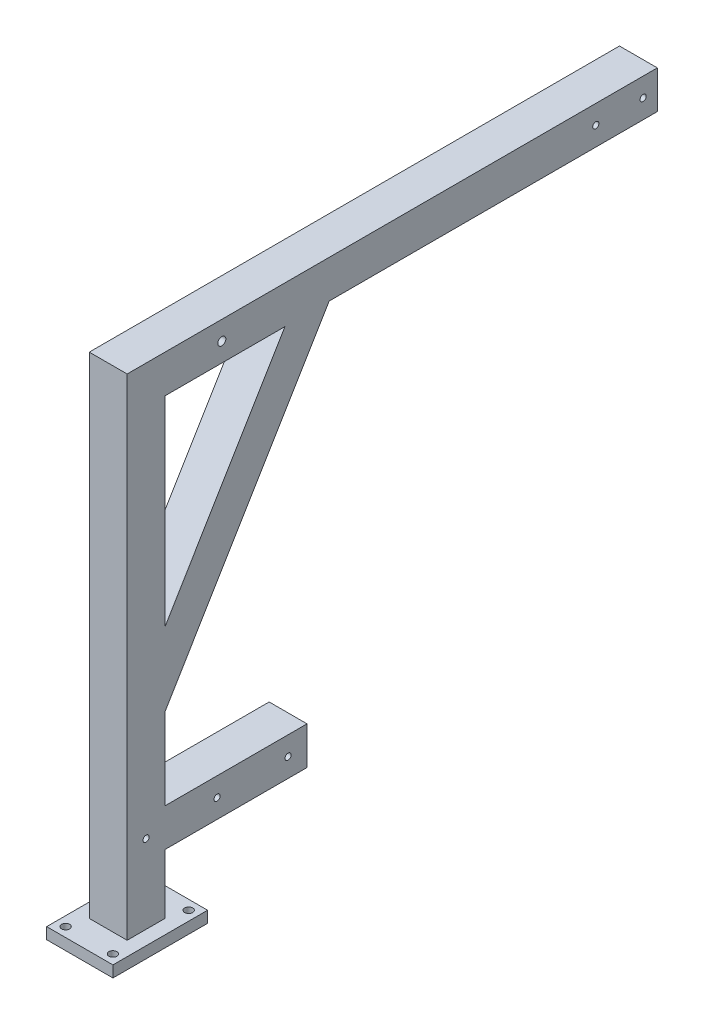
ISO-10303-21;
HEADER;
FILE_DESCRIPTION(('STEP AP214'),'2;1');
FILE_NAME('part.step','',(''),(''),'','','');
FILE_SCHEMA(('AUTOMOTIVE_DESIGN { 1 0 10303 214 1 1 1 1 }'));
ENDSEC;
DATA;
#1=APPLICATION_CONTEXT('core data for automotive mechanical design processes');
#2=APPLICATION_PROTOCOL_DEFINITION('international standard','automotive_design',2000,#1);
#3=PRODUCT_CONTEXT('',#1,'mechanical');
#4=PRODUCT('Part','Part','',(#3));
#5=PRODUCT_RELATED_PRODUCT_CATEGORY('part','',(#4));
#6=PRODUCT_DEFINITION_FORMATION('','',#4);
#7=PRODUCT_DEFINITION_CONTEXT('part definition',#1,'design');
#8=PRODUCT_DEFINITION('design','',#6,#7);
#9=PRODUCT_DEFINITION_SHAPE('','',#8);
#10=(LENGTH_UNIT() NAMED_UNIT(*) SI_UNIT(.MILLI.,.METRE.));
#11=(NAMED_UNIT(*) PLANE_ANGLE_UNIT() SI_UNIT($,.RADIAN.));
#12=(NAMED_UNIT(*) SI_UNIT($,.STERADIAN.) SOLID_ANGLE_UNIT());
#13=UNCERTAINTY_MEASURE_WITH_UNIT(LENGTH_MEASURE(1.E-05),#10,'distance_accuracy_value','');
#14=(GEOMETRIC_REPRESENTATION_CONTEXT(3) GLOBAL_UNCERTAINTY_ASSIGNED_CONTEXT((#13)) GLOBAL_UNIT_ASSIGNED_CONTEXT((#10,
#11,#12)) REPRESENTATION_CONTEXT('',''));
#15=CARTESIAN_POINT('',(0.,0.,0.));
#16=DIRECTION('',(0.,0.,1.));
#17=DIRECTION('',(1.,0.,0.));
#18=AXIS2_PLACEMENT_3D('',#15,#16,#17);
#19=CARTESIAN_POINT('',(70.,0.,590.));
#20=DIRECTION('',(0.,1.,0.));
#21=DIRECTION('',(0.,0.,1.));
#22=AXIS2_PLACEMENT_3D('',#19,#20,#21);
#23=PLANE('',#22);
#24=CARTESIAN_POINT('',(10.,0.,580.));
#25=DIRECTION('',(0.,1.,0.));
#26=DIRECTION('',(0.,0.,1.));
#27=AXIS2_PLACEMENT_3D('',#24,#25,#26);
#28=CIRCLE('',#27,4.25);
#29=CARTESIAN_POINT('',(10.,0.,584.25));
#30=VERTEX_POINT('',#29);
#31=EDGE_CURVE('E318',#30,#30,#28,.T.);
#32=ORIENTED_EDGE('',*,*,#31,.T.);
#33=EDGE_LOOP('',(#32));
#34=FACE_BOUND('',#33,.T.);
#35=CARTESIAN_POINT('',(60.,0.,580.));
#36=DIRECTION('',(0.,1.,0.));
#37=DIRECTION('',(0.,0.,1.));
#38=AXIS2_PLACEMENT_3D('',#35,#36,#37);
#39=CIRCLE('',#38,4.25);
#40=CARTESIAN_POINT('',(60.,0.,584.25));
#41=VERTEX_POINT('',#40);
#42=EDGE_CURVE('E312',#41,#41,#39,.T.);
#43=ORIENTED_EDGE('',*,*,#42,.T.);
#44=EDGE_LOOP('',(#43));
#45=FACE_BOUND('',#44,.T.);
#46=CARTESIAN_POINT('',(60.,0.,500.));
#47=DIRECTION('',(0.,1.,0.));
#48=DIRECTION('',(0.,0.,1.));
#49=AXIS2_PLACEMENT_3D('',#46,#47,#48);
#50=CIRCLE('',#49,4.25);
#51=CARTESIAN_POINT('',(60.,0.,504.25));
#52=VERTEX_POINT('',#51);
#53=EDGE_CURVE('E306',#52,#52,#50,.T.);
#54=ORIENTED_EDGE('',*,*,#53,.T.);
#55=EDGE_LOOP('',(#54));
#56=FACE_BOUND('',#55,.T.);
#57=CARTESIAN_POINT('',(10.,0.,500.));
#58=DIRECTION('',(0.,1.,0.));
#59=DIRECTION('',(0.,0.,1.));
#60=AXIS2_PLACEMENT_3D('',#57,#58,#59);
#61=CIRCLE('',#60,4.25);
#62=CARTESIAN_POINT('',(10.,0.,504.25));
#63=VERTEX_POINT('',#62);
#64=EDGE_CURVE('E300',#63,#63,#61,.T.);
#65=ORIENTED_EDGE('',*,*,#64,.T.);
#66=EDGE_LOOP('',(#65));
#67=FACE_BOUND('',#66,.T.);
#68=DIRECTION('',(-1.,0.,0.));
#69=VECTOR('',#68,1.);
#70=CARTESIAN_POINT('',(15.,0.,490.));
#71=LINE('',#70,#69);
#72=CARTESIAN_POINT('',(70.,0.,490.));
#73=VERTEX_POINT('',#72);
#74=CARTESIAN_POINT('',(0.,0.,490.));
#75=VERTEX_POINT('',#74);
#76=EDGE_CURVE('E278',#73,#75,#71,.T.);
#77=ORIENTED_EDGE('',*,*,#76,.F.);
#78=DIRECTION('',(0.,0.,-1.));
#79=VECTOR('',#78,1.);
#80=CARTESIAN_POINT('',(70.,0.,590.));
#81=LINE('',#80,#79);
#82=CARTESIAN_POINT('',(70.,0.,590.));
#83=VERTEX_POINT('',#82);
#84=EDGE_CURVE('E270',#83,#73,#81,.T.);
#85=ORIENTED_EDGE('',*,*,#84,.F.);
#86=DIRECTION('',(1.,0.,0.));
#87=VECTOR('',#86,1.);
#88=CARTESIAN_POINT('',(70.,0.,590.));
#89=LINE('',#88,#87);
#90=CARTESIAN_POINT('',(0.,0.,590.));
#91=VERTEX_POINT('',#90);
#92=EDGE_CURVE('E280',#91,#83,#89,.T.);
#93=ORIENTED_EDGE('',*,*,#92,.F.);
#94=DIRECTION('',(0.,0.,-1.));
#95=VECTOR('',#94,1.);
#96=CARTESIAN_POINT('',(0.,0.,590.));
#97=LINE('',#96,#95);
#98=EDGE_CURVE('E189',#91,#75,#97,.T.);
#99=ORIENTED_EDGE('',*,*,#98,.T.);
#100=EDGE_LOOP('',(#77,#85,#93,#99));
#101=FACE_BOUND('',#100,.T.);
#102=ADVANCED_FACE('F34',(#34,#45,#56,#67,#101),#23,.F.);
#103=CARTESIAN_POINT('',(55.,12.,0.));
#104=DIRECTION('',(0.,0.,-1.));
#105=DIRECTION('',(-1.,0.,0.));
#106=AXIS2_PLACEMENT_3D('',#103,#104,#105);
#107=PLANE('',#106);
#108=DIRECTION('',(0.,1.,0.));
#109=VECTOR('',#108,1.);
#110=CARTESIAN_POINT('',(55.,489.999999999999,0.));
#111=LINE('',#110,#109);
#112=CARTESIAN_POINT('',(55.,490.,0.));
#113=VERTEX_POINT('',#112);
#114=CARTESIAN_POINT('',(55.,529.999999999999,0.));
#115=VERTEX_POINT('',#114);
#116=EDGE_CURVE('E256',#113,#115,#111,.T.);
#117=ORIENTED_EDGE('',*,*,#116,.F.);
#118=DIRECTION('',(1.,0.,0.));
#119=VECTOR('',#118,1.);
#120=CARTESIAN_POINT('',(-520.,490.,0.));
#121=LINE('',#120,#119);
#122=CARTESIAN_POINT('',(15.,490.,0.));
#123=VERTEX_POINT('',#122);
#124=EDGE_CURVE('E243',#123,#113,#121,.T.);
#125=ORIENTED_EDGE('',*,*,#124,.F.);
#126=DIRECTION('',(0.,-1.,0.));
#127=VECTOR('',#126,1.);
#128=CARTESIAN_POINT('',(15.,12.,0.));
#129=LINE('',#128,#127);
#130=CARTESIAN_POINT('',(15.,529.999999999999,0.));
#131=VERTEX_POINT('',#130);
#132=EDGE_CURVE('E254',#131,#123,#129,.T.);
#133=ORIENTED_EDGE('',*,*,#132,.F.);
#134=DIRECTION('',(-1.,0.,0.));
#135=VECTOR('',#134,1.);
#136=CARTESIAN_POINT('',(55.,529.999999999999,0.));
#137=LINE('',#136,#135);
#138=EDGE_CURVE('E261',#115,#131,#137,.T.);
#139=ORIENTED_EDGE('',*,*,#138,.F.);
#140=EDGE_LOOP('',(#117,#125,#133,#139));
#141=FACE_BOUND('',#140,.T.);
#142=ADVANCED_FACE('F252',(#141),#107,.T.);
#143=CARTESIAN_POINT('',(55.,489.999999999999,590.));
#144=DIRECTION('',(-1.,0.,0.));
#145=DIRECTION('',(0.,0.,1.));
#146=AXIS2_PLACEMENT_3D('',#143,#144,#145);
#147=PLANE('',#146);
#148=CARTESIAN_POINT('',(55.,510.,65.));
#149=DIRECTION('',(-1.,0.,0.));
#150=DIRECTION('',(0.,0.,1.));
#151=AXIS2_PLACEMENT_3D('',#148,#149,#150);
#152=CIRCLE('',#151,3.25);
#153=CARTESIAN_POINT('',(55.,510.,68.25));
#154=VERTEX_POINT('',#153);
#155=EDGE_CURVE('E225',#154,#154,#152,.T.);
#156=ORIENTED_EDGE('',*,*,#155,.T.);
#157=EDGE_LOOP('',(#156));
#158=FACE_BOUND('',#157,.T.);
#159=CARTESIAN_POINT('',(55.,510.,15.));
#160=DIRECTION('',(-1.,0.,0.));
#161=DIRECTION('',(0.,0.,1.));
#162=AXIS2_PLACEMENT_3D('',#159,#160,#161);
#163=CIRCLE('',#162,3.25);
#164=CARTESIAN_POINT('',(55.,510.,18.25));
#165=VERTEX_POINT('',#164);
#166=EDGE_CURVE('E221',#165,#165,#163,.T.);
#167=ORIENTED_EDGE('',*,*,#166,.T.);
#168=EDGE_LOOP('',(#167));
#169=FACE_BOUND('',#168,.T.);
#170=CARTESIAN_POINT('',(55.,510.,460.));
#171=DIRECTION('',(-1.,0.,0.));
#172=DIRECTION('',(0.,0.,1.));
#173=AXIS2_PLACEMENT_3D('',#170,#171,#172);
#174=CIRCLE('',#173,4.24999999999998);
#175=CARTESIAN_POINT('',(55.,510.,464.25));
#176=VERTEX_POINT('',#175);
#177=EDGE_CURVE('E217',#176,#176,#174,.T.);
#178=ORIENTED_EDGE('',*,*,#177,.T.);
#179=EDGE_LOOP('',(#178));
#180=FACE_BOUND('',#179,.T.);
#181=CARTESIAN_POINT('',(55.,94.9999999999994,540.));
#182=DIRECTION('',(-1.,0.,0.));
#183=DIRECTION('',(0.,0.,1.));
#184=AXIS2_PLACEMENT_3D('',#181,#182,#183);
#185=CIRCLE('',#184,3.24999999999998);
#186=CARTESIAN_POINT('',(55.,94.9999999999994,543.25));
#187=VERTEX_POINT('',#186);
#188=EDGE_CURVE('E213',#187,#187,#185,.T.);
#189=ORIENTED_EDGE('',*,*,#188,.T.);
#190=EDGE_LOOP('',(#189));
#191=FACE_BOUND('',#190,.T.);
#192=CARTESIAN_POINT('',(55.,94.9999999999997,465.));
#193=DIRECTION('',(-1.,0.,0.));
#194=DIRECTION('',(0.,0.,1.));
#195=AXIS2_PLACEMENT_3D('',#192,#193,#194);
#196=CIRCLE('',#195,3.24999999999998);
#197=CARTESIAN_POINT('',(55.,94.9999999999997,468.25));
#198=VERTEX_POINT('',#197);
#199=EDGE_CURVE('E209',#198,#198,#196,.T.);
#200=ORIENTED_EDGE('',*,*,#199,.T.);
#201=EDGE_LOOP('',(#200));
#202=FACE_BOUND('',#201,.T.);
#203=CARTESIAN_POINT('',(55.,94.9999999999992,390.));
#204=DIRECTION('',(-1.,0.,0.));
#205=DIRECTION('',(0.,0.,1.));
#206=AXIS2_PLACEMENT_3D('',#203,#204,#205);
#207=CIRCLE('',#206,3.24999999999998);
#208=CARTESIAN_POINT('',(55.,94.9999999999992,393.25));
#209=VERTEX_POINT('',#208);
#210=EDGE_CURVE('E208',#209,#209,#207,.T.);
#211=ORIENTED_EDGE('',*,*,#210,.T.);
#212=EDGE_LOOP('',(#211));
#213=FACE_BOUND('',#212,.T.);
#214=DIRECTION('',(0.,-0.857492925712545,0.514495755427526));
#215=VECTOR('',#214,1.);
#216=CARTESIAN_POINT('',(55.,403.231091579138,445.385152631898));
#217=LINE('',#216,#215);
#218=CARTESIAN_POINT('',(55.,490.,393.323807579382));
#219=VERTEX_POINT('',#218);
#220=CARTESIAN_POINT('',(55.,278.873012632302,520.));
#221=VERTEX_POINT('',#220);
#222=EDGE_CURVE('E380',#219,#221,#217,.T.);
#223=ORIENTED_EDGE('',*,*,#222,.T.);
#224=DIRECTION('',(0.,1.,0.));
#225=VECTOR('',#224,1.);
#226=CARTESIAN_POINT('',(55.,489.999999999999,520.));
#227=LINE('',#226,#225);
#228=CARTESIAN_POINT('',(55.,490.,520.));
#229=VERTEX_POINT('',#228);
#230=EDGE_CURVE('E296',#221,#229,#227,.T.);
#231=ORIENTED_EDGE('',*,*,#230,.T.);
#232=DIRECTION('',(0.,0.,-1.));
#233=VECTOR('',#232,1.);
#234=CARTESIAN_POINT('',(55.,490.,590.));
#235=LINE('',#234,#233);
#236=EDGE_CURVE('E385',#229,#219,#235,.T.);
#237=ORIENTED_EDGE('',*,*,#236,.T.);
#238=EDGE_LOOP('',(#223,#231,#237));
#239=FACE_BOUND('',#238,.T.);
#240=DIRECTION('',(0.,1.,0.));
#241=VECTOR('',#240,1.);
#242=CARTESIAN_POINT('',(55.,489.999999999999,560.));
#243=LINE('',#242,#241);
#244=CARTESIAN_POINT('',(55.,11.9999999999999,560.));
#245=VERTEX_POINT('',#244);
#246=CARTESIAN_POINT('',(55.,530.,560.));
#247=VERTEX_POINT('',#246);
#248=EDGE_CURVE('E228',#245,#247,#243,.T.);
#249=ORIENTED_EDGE('',*,*,#248,.F.);
#250=DIRECTION('',(0.,0.,-1.));
#251=VECTOR('',#250,1.);
#252=CARTESIAN_POINT('',(55.,12.,590.));
#253=LINE('',#252,#251);
#254=CARTESIAN_POINT('',(55.,11.9999999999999,520.));
#255=VERTEX_POINT('',#254);
#256=EDGE_CURVE('E195',#245,#255,#253,.T.);
#257=ORIENTED_EDGE('',*,*,#256,.T.);
#258=DIRECTION('',(0.,-1.,0.));
#259=VECTOR('',#258,1.);
#260=CARTESIAN_POINT('',(55.,489.999999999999,520.));
#261=LINE('',#260,#259);
#262=CARTESIAN_POINT('',(55.,74.9999999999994,520.));
#263=VERTEX_POINT('',#262);
#264=EDGE_CURVE('E163',#263,#255,#261,.T.);
#265=ORIENTED_EDGE('',*,*,#264,.F.);
#266=DIRECTION('',(0.,0.,1.));
#267=VECTOR('',#266,1.);
#268=CARTESIAN_POINT('',(55.,74.9999999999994,590.));
#269=LINE('',#268,#267);
#270=CARTESIAN_POINT('',(55.,74.9999999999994,370.));
#271=VERTEX_POINT('',#270);
#272=EDGE_CURVE('E353',#271,#263,#269,.T.);
#273=ORIENTED_EDGE('',*,*,#272,.F.);
#274=DIRECTION('',(0.,-1.,0.));
#275=VECTOR('',#274,1.);
#276=CARTESIAN_POINT('',(55.,489.999999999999,370.));
#277=LINE('',#276,#275);
#278=CARTESIAN_POINT('',(55.,114.999999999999,370.));
#279=VERTEX_POINT('',#278);
#280=EDGE_CURVE('E355',#279,#271,#277,.T.);
#281=ORIENTED_EDGE('',*,*,#280,.F.);
#282=DIRECTION('',(0.,0.,-1.));
#283=VECTOR('',#282,1.);
#284=CARTESIAN_POINT('',(55.,114.999999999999,590.));
#285=LINE('',#284,#283);
#286=CARTESIAN_POINT('',(55.,114.999999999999,520.));
#287=VERTEX_POINT('',#286);
#288=EDGE_CURVE('E357',#287,#279,#285,.T.);
#289=ORIENTED_EDGE('',*,*,#288,.F.);
#290=DIRECTION('',(0.,-1.,0.));
#291=VECTOR('',#290,1.);
#292=CARTESIAN_POINT('',(55.,489.999999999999,520.));
#293=LINE('',#292,#291);
#294=CARTESIAN_POINT('',(55.,201.126987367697,520.));
#295=VERTEX_POINT('',#294);
#296=EDGE_CURVE('E359',#295,#287,#293,.T.);
#297=ORIENTED_EDGE('',*,*,#296,.F.);
#298=DIRECTION('',(0.,-0.857492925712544,0.514495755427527));
#299=VECTOR('',#298,1.);
#300=CARTESIAN_POINT('',(55.,382.651261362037,411.085435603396));
#301=LINE('',#300,#299);
#302=CARTESIAN_POINT('',(55.,490.,346.676192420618));
#303=VERTEX_POINT('',#302);
#304=EDGE_CURVE('E361',#303,#295,#301,.T.);
#305=ORIENTED_EDGE('',*,*,#304,.F.);
#306=DIRECTION('',(0.,0.,1.));
#307=VECTOR('',#306,1.);
#308=CARTESIAN_POINT('',(55.,490.,590.));
#309=LINE('',#308,#307);
#310=EDGE_CURVE('E330',#113,#303,#309,.T.);
#311=ORIENTED_EDGE('',*,*,#310,.F.);
#312=ORIENTED_EDGE('',*,*,#116,.T.);
#313=DIRECTION('',(0.,0.,-1.));
#314=VECTOR('',#313,1.);
#315=CARTESIAN_POINT('',(55.,529.999999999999,590.));
#316=LINE('',#315,#314);
#317=EDGE_CURVE('E187',#247,#115,#316,.T.);
#318=ORIENTED_EDGE('',*,*,#317,.F.);
#319=EDGE_LOOP('',(#249,#257,#265,#273,#281,#289,#297,#305,#311,#312,#318));
#320=FACE_BOUND('',#319,.T.);
#321=ADVANCED_FACE('F36',(#158,#169,#180,#191,#202,#213,#239,#320),#147,.F.);
#322=CARTESIAN_POINT('',(55.,529.999999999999,590.));
#323=DIRECTION('',(0.,-1.,0.));
#324=DIRECTION('',(0.,0.,-1.));
#325=AXIS2_PLACEMENT_3D('',#322,#323,#324);
#326=PLANE('',#325);
#327=DIRECTION('',(1.,0.,0.));
#328=VECTOR('',#327,1.);
#329=CARTESIAN_POINT('',(-520.,530.,560.));
#330=LINE('',#329,#328);
#331=CARTESIAN_POINT('',(15.,530.,560.));
#332=VERTEX_POINT('',#331);
#333=EDGE_CURVE('E257',#332,#247,#330,.T.);
#334=ORIENTED_EDGE('',*,*,#333,.T.);
#335=ORIENTED_EDGE('',*,*,#317,.T.);
#336=ORIENTED_EDGE('',*,*,#138,.T.);
#337=DIRECTION('',(0.,0.,-1.));
#338=VECTOR('',#337,1.);
#339=CARTESIAN_POINT('',(15.,529.999999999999,590.));
#340=LINE('',#339,#338);
#341=EDGE_CURVE('E184',#332,#131,#340,.T.);
#342=ORIENTED_EDGE('',*,*,#341,.F.);
#343=EDGE_LOOP('',(#334,#335,#336,#342));
#344=FACE_BOUND('',#343,.T.);
#345=ADVANCED_FACE('F333',(#344),#326,.F.);
#346=CARTESIAN_POINT('',(15.,12.,590.));
#347=DIRECTION('',(1.,0.,0.));
#348=DIRECTION('',(0.,0.,-1.));
#349=AXIS2_PLACEMENT_3D('',#346,#347,#348);
#350=PLANE('',#349);
#351=CARTESIAN_POINT('',(15.,510.,65.));
#352=DIRECTION('',(1.,0.,0.));
#353=DIRECTION('',(0.,0.,-1.));
#354=AXIS2_PLACEMENT_3D('',#351,#352,#353);
#355=CIRCLE('',#354,3.25);
#356=CARTESIAN_POINT('',(15.,510.,61.75));
#357=VERTEX_POINT('',#356);
#358=EDGE_CURVE('E226',#357,#357,#355,.T.);
#359=ORIENTED_EDGE('',*,*,#358,.T.);
#360=EDGE_LOOP('',(#359));
#361=FACE_BOUND('',#360,.T.);
#362=CARTESIAN_POINT('',(15.,510.,15.));
#363=DIRECTION('',(1.,0.,0.));
#364=DIRECTION('',(0.,0.,-1.));
#365=AXIS2_PLACEMENT_3D('',#362,#363,#364);
#366=CIRCLE('',#365,3.25);
#367=CARTESIAN_POINT('',(15.,510.,11.75));
#368=VERTEX_POINT('',#367);
#369=EDGE_CURVE('E222',#368,#368,#366,.T.);
#370=ORIENTED_EDGE('',*,*,#369,.T.);
#371=EDGE_LOOP('',(#370));
#372=FACE_BOUND('',#371,.T.);
#373=CARTESIAN_POINT('',(15.,510.,460.));
#374=DIRECTION('',(1.,0.,0.));
#375=DIRECTION('',(0.,0.,-1.));
#376=AXIS2_PLACEMENT_3D('',#373,#374,#375);
#377=CIRCLE('',#376,4.24999999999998);
#378=CARTESIAN_POINT('',(15.,510.,455.75));
#379=VERTEX_POINT('',#378);
#380=EDGE_CURVE('E218',#379,#379,#377,.T.);
#381=ORIENTED_EDGE('',*,*,#380,.T.);
#382=EDGE_LOOP('',(#381));
#383=FACE_BOUND('',#382,.T.);
#384=CARTESIAN_POINT('',(15.,94.9999999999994,540.));
#385=DIRECTION('',(1.,0.,0.));
#386=DIRECTION('',(0.,0.,-1.));
#387=AXIS2_PLACEMENT_3D('',#384,#385,#386);
#388=CIRCLE('',#387,3.24999999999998);
#389=CARTESIAN_POINT('',(15.,94.9999999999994,536.75));
#390=VERTEX_POINT('',#389);
#391=EDGE_CURVE('E214',#390,#390,#388,.T.);
#392=ORIENTED_EDGE('',*,*,#391,.T.);
#393=EDGE_LOOP('',(#392));
#394=FACE_BOUND('',#393,.T.);
#395=CARTESIAN_POINT('',(15.,94.9999999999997,465.));
#396=DIRECTION('',(1.,0.,0.));
#397=DIRECTION('',(0.,0.,-1.));
#398=AXIS2_PLACEMENT_3D('',#395,#396,#397);
#399=CIRCLE('',#398,3.24999999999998);
#400=CARTESIAN_POINT('',(15.,94.9999999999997,461.75));
#401=VERTEX_POINT('',#400);
#402=EDGE_CURVE('E210',#401,#401,#399,.T.);
#403=ORIENTED_EDGE('',*,*,#402,.T.);
#404=EDGE_LOOP('',(#403));
#405=FACE_BOUND('',#404,.T.);
#406=CARTESIAN_POINT('',(15.,94.9999999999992,390.));
#407=DIRECTION('',(1.,0.,0.));
#408=DIRECTION('',(0.,0.,-1.));
#409=AXIS2_PLACEMENT_3D('',#406,#407,#408);
#410=CIRCLE('',#409,3.24999999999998);
#411=CARTESIAN_POINT('',(15.,94.9999999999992,386.75));
#412=VERTEX_POINT('',#411);
#413=EDGE_CURVE('E205',#412,#412,#410,.T.);
#414=ORIENTED_EDGE('',*,*,#413,.T.);
#415=EDGE_LOOP('',(#414));
#416=FACE_BOUND('',#415,.T.);
#417=DIRECTION('',(0.,0.,1.));
#418=VECTOR('',#417,1.);
#419=CARTESIAN_POINT('',(15.,490.,590.));
#420=LINE('',#419,#418);
#421=CARTESIAN_POINT('',(15.,489.999999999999,393.323807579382));
#422=VERTEX_POINT('',#421);
#423=CARTESIAN_POINT('',(15.,490.,520.));
#424=VERTEX_POINT('',#423);
#425=EDGE_CURVE('E200',#422,#424,#420,.T.);
#426=ORIENTED_EDGE('',*,*,#425,.T.);
#427=DIRECTION('',(0.,-1.,0.));
#428=VECTOR('',#427,1.);
#429=CARTESIAN_POINT('',(15.,12.,520.));
#430=LINE('',#429,#428);
#431=CARTESIAN_POINT('',(15.,278.873012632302,520.));
#432=VERTEX_POINT('',#431);
#433=EDGE_CURVE('E178',#424,#432,#430,.T.);
#434=ORIENTED_EDGE('',*,*,#433,.T.);
#435=DIRECTION('',(0.,0.857492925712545,-0.514495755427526));
#436=VECTOR('',#435,1.);
#437=CARTESIAN_POINT('',(15.,51.7605033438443,656.267505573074));
#438=LINE('',#437,#436);
#439=EDGE_CURVE('E197',#432,#422,#438,.T.);
#440=ORIENTED_EDGE('',*,*,#439,.T.);
#441=EDGE_LOOP('',(#426,#434,#440));
#442=FACE_BOUND('',#441,.T.);
#443=DIRECTION('',(0.,-1.,0.));
#444=VECTOR('',#443,1.);
#445=CARTESIAN_POINT('',(15.,12.,560.));
#446=LINE('',#445,#444);
#447=CARTESIAN_POINT('',(15.,11.9999999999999,560.));
#448=VERTEX_POINT('',#447);
#449=EDGE_CURVE('E12',#332,#448,#446,.T.);
#450=ORIENTED_EDGE('',*,*,#449,.F.);
#451=ORIENTED_EDGE('',*,*,#341,.T.);
#452=ORIENTED_EDGE('',*,*,#132,.T.);
#453=DIRECTION('',(0.,0.,-1.));
#454=VECTOR('',#453,1.);
#455=CARTESIAN_POINT('',(15.,490.,590.));
#456=LINE('',#455,#454);
#457=CARTESIAN_POINT('',(15.,490.,346.676192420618));
#458=VERTEX_POINT('',#457);
#459=EDGE_CURVE('E42',#458,#123,#456,.T.);
#460=ORIENTED_EDGE('',*,*,#459,.F.);
#461=DIRECTION('',(0.,0.857492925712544,-0.514495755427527));
#462=VECTOR('',#461,1.);
#463=CARTESIAN_POINT('',(15.,31.1806731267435,621.967788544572));
#464=LINE('',#463,#462);
#465=CARTESIAN_POINT('',(15.,201.126987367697,520.));
#466=VERTEX_POINT('',#465);
#467=EDGE_CURVE('E237',#466,#458,#464,.T.);
#468=ORIENTED_EDGE('',*,*,#467,.F.);
#469=DIRECTION('',(0.,1.,0.));
#470=VECTOR('',#469,1.);
#471=CARTESIAN_POINT('',(15.,12.,520.));
#472=LINE('',#471,#470);
#473=CARTESIAN_POINT('',(15.,114.999999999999,520.));
#474=VERTEX_POINT('',#473);
#475=EDGE_CURVE('E235',#474,#466,#472,.T.);
#476=ORIENTED_EDGE('',*,*,#475,.F.);
#477=DIRECTION('',(0.,0.,1.));
#478=VECTOR('',#477,1.);
#479=CARTESIAN_POINT('',(15.,114.999999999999,590.));
#480=LINE('',#479,#478);
#481=CARTESIAN_POINT('',(15.,114.999999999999,370.));
#482=VERTEX_POINT('',#481);
#483=EDGE_CURVE('E233',#482,#474,#480,.T.);
#484=ORIENTED_EDGE('',*,*,#483,.F.);
#485=DIRECTION('',(0.,1.,0.));
#486=VECTOR('',#485,1.);
#487=CARTESIAN_POINT('',(15.,12.,370.));
#488=LINE('',#487,#486);
#489=CARTESIAN_POINT('',(15.,74.9999999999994,370.));
#490=VERTEX_POINT('',#489);
#491=EDGE_CURVE('E231',#490,#482,#488,.T.);
#492=ORIENTED_EDGE('',*,*,#491,.F.);
#493=DIRECTION('',(0.,0.,-1.));
#494=VECTOR('',#493,1.);
#495=CARTESIAN_POINT('',(15.,74.9999999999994,590.));
#496=LINE('',#495,#494);
#497=CARTESIAN_POINT('',(15.,74.9999999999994,520.));
#498=VERTEX_POINT('',#497);
#499=EDGE_CURVE('E177',#498,#490,#496,.T.);
#500=ORIENTED_EDGE('',*,*,#499,.F.);
#501=DIRECTION('',(0.,1.,0.));
#502=VECTOR('',#501,1.);
#503=CARTESIAN_POINT('',(15.,12.,520.));
#504=LINE('',#503,#502);
#505=CARTESIAN_POINT('',(15.,11.9999999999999,520.));
#506=VERTEX_POINT('',#505);
#507=EDGE_CURVE('E160',#506,#498,#504,.T.);
#508=ORIENTED_EDGE('',*,*,#507,.F.);
#509=DIRECTION('',(0.,0.,-1.));
#510=VECTOR('',#509,1.);
#511=CARTESIAN_POINT('',(15.,12.,590.));
#512=LINE('',#511,#510);
#513=EDGE_CURVE('E175',#448,#506,#512,.T.);
#514=ORIENTED_EDGE('',*,*,#513,.F.);
#515=EDGE_LOOP('',(#450,#451,#452,#460,#468,#476,#484,#492,#500,#508,#514));
#516=FACE_BOUND('',#515,.T.);
#517=ADVANCED_FACE('F174',(#361,#372,#383,#394,#405,#416,#442,#516),#350,.F.);
#518=CARTESIAN_POINT('',(55.,12.,590.));
#519=DIRECTION('',(0.,0.,-1.));
#520=DIRECTION('',(-1.,0.,0.));
#521=AXIS2_PLACEMENT_3D('',#518,#519,#520);
#522=PLANE('',#521);
#523=DIRECTION('',(-1.,0.,0.));
#524=VECTOR('',#523,1.);
#525=CARTESIAN_POINT('',(70.,12.,590.));
#526=LINE('',#525,#524);
#527=CARTESIAN_POINT('',(70.,12.,590.));
#528=VERTEX_POINT('',#527);
#529=CARTESIAN_POINT('',(0.,12.,590.));
#530=VERTEX_POINT('',#529);
#531=EDGE_CURVE('E260',#528,#530,#526,.T.);
#532=ORIENTED_EDGE('',*,*,#531,.T.);
#533=DIRECTION('',(0.,-1.,0.));
#534=VECTOR('',#533,1.);
#535=CARTESIAN_POINT('',(0.,0.,590.));
#536=LINE('',#535,#534);
#537=EDGE_CURVE('E263',#530,#91,#536,.T.);
#538=ORIENTED_EDGE('',*,*,#537,.T.);
#539=ORIENTED_EDGE('',*,*,#92,.T.);
#540=DIRECTION('',(0.,1.,0.));
#541=VECTOR('',#540,1.);
#542=CARTESIAN_POINT('',(70.,0.,590.));
#543=LINE('',#542,#541);
#544=EDGE_CURVE('E271',#83,#528,#543,.T.);
#545=ORIENTED_EDGE('',*,*,#544,.T.);
#546=EDGE_LOOP('',(#532,#538,#539,#545));
#547=FACE_BOUND('',#546,.T.);
#548=ADVANCED_FACE('F424',(#547),#522,.F.);
#549=CARTESIAN_POINT('',(15.,12.,590.));
#550=DIRECTION('',(0.,-1.,0.));
#551=DIRECTION('',(0.,0.,-1.));
#552=AXIS2_PLACEMENT_3D('',#549,#550,#551);
#553=PLANE('',#552);
#554=ORIENTED_EDGE('',*,*,#256,.F.);
#555=DIRECTION('',(1.,0.,0.));
#556=VECTOR('',#555,1.);
#557=CARTESIAN_POINT('',(-520.,11.9999999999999,560.));
#558=LINE('',#557,#556);
#559=EDGE_CURVE('E183',#448,#245,#558,.T.);
#560=ORIENTED_EDGE('',*,*,#559,.F.);
#561=ORIENTED_EDGE('',*,*,#513,.T.);
#562=DIRECTION('',(1.,0.,0.));
#563=VECTOR('',#562,1.);
#564=CARTESIAN_POINT('',(-520.,11.9999999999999,520.));
#565=LINE('',#564,#563);
#566=EDGE_CURVE('E156',#506,#255,#565,.T.);
#567=ORIENTED_EDGE('',*,*,#566,.T.);
#568=EDGE_LOOP('',(#554,#560,#561,#567));
#569=FACE_BOUND('',#568,.T.);
#570=CARTESIAN_POINT('',(10.,12.,500.));
#571=DIRECTION('',(0.,-1.,0.));
#572=DIRECTION('',(0.,0.,-1.));
#573=AXIS2_PLACEMENT_3D('',#570,#571,#572);
#574=CIRCLE('',#573,4.25);
#575=CARTESIAN_POINT('',(10.,12.,495.75));
#576=VERTEX_POINT('',#575);
#577=EDGE_CURVE('E303',#576,#576,#574,.T.);
#578=ORIENTED_EDGE('',*,*,#577,.T.);
#579=EDGE_LOOP('',(#578));
#580=FACE_BOUND('',#579,.T.);
#581=DIRECTION('',(1.,0.,0.));
#582=VECTOR('',#581,1.);
#583=CARTESIAN_POINT('',(70.,12.,490.));
#584=LINE('',#583,#582);
#585=CARTESIAN_POINT('',(0.,12.,490.));
#586=VERTEX_POINT('',#585);
#587=CARTESIAN_POINT('',(70.,12.,490.));
#588=VERTEX_POINT('',#587);
#589=EDGE_CURVE('E294',#586,#588,#584,.T.);
#590=ORIENTED_EDGE('',*,*,#589,.F.);
#591=DIRECTION('',(0.,0.,-1.));
#592=VECTOR('',#591,1.);
#593=CARTESIAN_POINT('',(0.,12.,590.));
#594=LINE('',#593,#592);
#595=EDGE_CURVE('E185',#530,#586,#594,.T.);
#596=ORIENTED_EDGE('',*,*,#595,.F.);
#597=ORIENTED_EDGE('',*,*,#531,.F.);
#598=DIRECTION('',(0.,0.,-1.));
#599=VECTOR('',#598,1.);
#600=CARTESIAN_POINT('',(70.,12.,590.));
#601=LINE('',#600,#599);
#602=EDGE_CURVE('E268',#528,#588,#601,.T.);
#603=ORIENTED_EDGE('',*,*,#602,.T.);
#604=EDGE_LOOP('',(#590,#596,#597,#603));
#605=FACE_BOUND('',#604,.T.);
#606=CARTESIAN_POINT('',(60.,12.,500.));
#607=DIRECTION('',(0.,-1.,0.));
#608=DIRECTION('',(0.,0.,-1.));
#609=AXIS2_PLACEMENT_3D('',#606,#607,#608);
#610=CIRCLE('',#609,4.25);
#611=CARTESIAN_POINT('',(60.,12.,495.75));
#612=VERTEX_POINT('',#611);
#613=EDGE_CURVE('E309',#612,#612,#610,.T.);
#614=ORIENTED_EDGE('',*,*,#613,.T.);
#615=EDGE_LOOP('',(#614));
#616=FACE_BOUND('',#615,.T.);
#617=CARTESIAN_POINT('',(10.,12.,580.));
#618=DIRECTION('',(0.,-1.,0.));
#619=DIRECTION('',(0.,0.,-1.));
#620=AXIS2_PLACEMENT_3D('',#617,#618,#619);
#621=CIRCLE('',#620,4.25);
#622=CARTESIAN_POINT('',(10.,12.,575.75));
#623=VERTEX_POINT('',#622);
#624=EDGE_CURVE('E321',#623,#623,#621,.T.);
#625=ORIENTED_EDGE('',*,*,#624,.T.);
#626=EDGE_LOOP('',(#625));
#627=FACE_BOUND('',#626,.T.);
#628=CARTESIAN_POINT('',(60.,12.,580.));
#629=DIRECTION('',(0.,-1.,0.));
#630=DIRECTION('',(0.,0.,-1.));
#631=AXIS2_PLACEMENT_3D('',#628,#629,#630);
#632=CIRCLE('',#631,4.25);
#633=CARTESIAN_POINT('',(60.,12.,575.75));
#634=VERTEX_POINT('',#633);
#635=EDGE_CURVE('E315',#634,#634,#632,.T.);
#636=ORIENTED_EDGE('',*,*,#635,.T.);
#637=EDGE_LOOP('',(#636));
#638=FACE_BOUND('',#637,.T.);
#639=ADVANCED_FACE('F181',(#569,#580,#605,#616,#627,#638),#553,.F.);
#640=CARTESIAN_POINT('',(0.,0.,590.));
#641=DIRECTION('',(1.,0.,0.));
#642=DIRECTION('',(0.,0.,-1.));
#643=AXIS2_PLACEMENT_3D('',#640,#641,#642);
#644=PLANE('',#643);
#645=DIRECTION('',(0.,1.,0.));
#646=VECTOR('',#645,1.);
#647=CARTESIAN_POINT('',(0.,0.,490.));
#648=LINE('',#647,#646);
#649=EDGE_CURVE('E286',#75,#586,#648,.T.);
#650=ORIENTED_EDGE('',*,*,#649,.F.);
#651=ORIENTED_EDGE('',*,*,#98,.F.);
#652=ORIENTED_EDGE('',*,*,#537,.F.);
#653=ORIENTED_EDGE('',*,*,#595,.T.);
#654=EDGE_LOOP('',(#650,#651,#652,#653));
#655=FACE_BOUND('',#654,.T.);
#656=ADVANCED_FACE('F284',(#655),#644,.F.);
#657=CARTESIAN_POINT('',(70.,0.,590.));
#658=DIRECTION('',(-1.,0.,0.));
#659=DIRECTION('',(0.,0.,1.));
#660=AXIS2_PLACEMENT_3D('',#657,#658,#659);
#661=PLANE('',#660);
#662=DIRECTION('',(0.,1.,0.));
#663=VECTOR('',#662,1.);
#664=CARTESIAN_POINT('',(70.,0.,490.));
#665=LINE('',#664,#663);
#666=EDGE_CURVE('E291',#73,#588,#665,.T.);
#667=ORIENTED_EDGE('',*,*,#666,.T.);
#668=ORIENTED_EDGE('',*,*,#602,.F.);
#669=ORIENTED_EDGE('',*,*,#544,.F.);
#670=ORIENTED_EDGE('',*,*,#84,.T.);
#671=EDGE_LOOP('',(#667,#668,#669,#670));
#672=FACE_BOUND('',#671,.T.);
#673=ADVANCED_FACE('F419',(#672),#661,.F.);
#674=CARTESIAN_POINT('',(10.,0.,580.));
#675=DIRECTION('',(0.,1.,0.));
#676=DIRECTION('',(0.,0.,1.));
#677=AXIS2_PLACEMENT_3D('',#674,#675,#676);
#678=CYLINDRICAL_SURFACE('',#677,4.25);
#679=ORIENTED_EDGE('',*,*,#31,.F.);
#680=EDGE_LOOP('',(#679));
#681=FACE_BOUND('',#680,.T.);
#682=ORIENTED_EDGE('',*,*,#624,.F.);
#683=EDGE_LOOP('',(#682));
#684=FACE_BOUND('',#683,.T.);
#685=ADVANCED_FACE('F642',(#681,#684),#678,.F.);
#686=CARTESIAN_POINT('',(60.,0.,580.));
#687=DIRECTION('',(0.,1.,0.));
#688=DIRECTION('',(0.,0.,1.));
#689=AXIS2_PLACEMENT_3D('',#686,#687,#688);
#690=CYLINDRICAL_SURFACE('',#689,4.25);
#691=ORIENTED_EDGE('',*,*,#42,.F.);
#692=EDGE_LOOP('',(#691));
#693=FACE_BOUND('',#692,.T.);
#694=ORIENTED_EDGE('',*,*,#635,.F.);
#695=EDGE_LOOP('',(#694));
#696=FACE_BOUND('',#695,.T.);
#697=ADVANCED_FACE('F651',(#693,#696),#690,.F.);
#698=CARTESIAN_POINT('',(60.,0.,500.));
#699=DIRECTION('',(0.,1.,0.));
#700=DIRECTION('',(0.,0.,1.));
#701=AXIS2_PLACEMENT_3D('',#698,#699,#700);
#702=CYLINDRICAL_SURFACE('',#701,4.25);
#703=ORIENTED_EDGE('',*,*,#53,.F.);
#704=EDGE_LOOP('',(#703));
#705=FACE_BOUND('',#704,.T.);
#706=ORIENTED_EDGE('',*,*,#613,.F.);
#707=EDGE_LOOP('',(#706));
#708=FACE_BOUND('',#707,.T.);
#709=ADVANCED_FACE('F659',(#705,#708),#702,.F.);
#710=CARTESIAN_POINT('',(10.,0.,500.));
#711=DIRECTION('',(0.,1.,0.));
#712=DIRECTION('',(0.,0.,1.));
#713=AXIS2_PLACEMENT_3D('',#710,#711,#712);
#714=CYLINDRICAL_SURFACE('',#713,4.25);
#715=ORIENTED_EDGE('',*,*,#64,.F.);
#716=EDGE_LOOP('',(#715));
#717=FACE_BOUND('',#716,.T.);
#718=ORIENTED_EDGE('',*,*,#577,.F.);
#719=EDGE_LOOP('',(#718));
#720=FACE_BOUND('',#719,.T.);
#721=ADVANCED_FACE('F610',(#717,#720),#714,.F.);
#722=CARTESIAN_POINT('',(15.,0.,490.));
#723=DIRECTION('',(0.,0.,-1.));
#724=DIRECTION('',(-1.,0.,0.));
#725=AXIS2_PLACEMENT_3D('',#722,#723,#724);
#726=PLANE('',#725);
#727=ORIENTED_EDGE('',*,*,#649,.T.);
#728=ORIENTED_EDGE('',*,*,#589,.T.);
#729=ORIENTED_EDGE('',*,*,#666,.F.);
#730=ORIENTED_EDGE('',*,*,#76,.T.);
#731=EDGE_LOOP('',(#727,#728,#729,#730));
#732=FACE_BOUND('',#731,.T.);
#733=ADVANCED_FACE('F602',(#732),#726,.T.);
#734=CARTESIAN_POINT('',(-520.,278.873012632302,520.));
#735=DIRECTION('',(0.,0.,1.));
#736=DIRECTION('',(1.,0.,0.));
#737=AXIS2_PLACEMENT_3D('',#734,#735,#736);
#738=PLANE('',#737);
#739=DIRECTION('',(1.,0.,0.));
#740=VECTOR('',#739,1.);
#741=CARTESIAN_POINT('',(-520.,278.873012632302,520.));
#742=LINE('',#741,#740);
#743=EDGE_CURVE('E49',#432,#221,#742,.T.);
#744=ORIENTED_EDGE('',*,*,#743,.F.);
#745=ORIENTED_EDGE('',*,*,#433,.F.);
#746=DIRECTION('',(1.,0.,0.));
#747=VECTOR('',#746,1.);
#748=CARTESIAN_POINT('',(-520.,490.,520.));
#749=LINE('',#748,#747);
#750=EDGE_CURVE('E377',#424,#229,#749,.T.);
#751=ORIENTED_EDGE('',*,*,#750,.T.);
#752=ORIENTED_EDGE('',*,*,#230,.F.);
#753=EDGE_LOOP('',(#744,#745,#751,#752));
#754=FACE_BOUND('',#753,.T.);
#755=ADVANCED_FACE('F391',(#754),#738,.F.);
#756=CARTESIAN_POINT('',(-520.,490.,393.323807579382));
#757=DIRECTION('',(0.,1.,0.));
#758=DIRECTION('',(0.,0.,1.));
#759=AXIS2_PLACEMENT_3D('',#756,#757,#758);
#760=PLANE('',#759);
#761=ORIENTED_EDGE('',*,*,#750,.F.);
#762=ORIENTED_EDGE('',*,*,#425,.F.);
#763=DIRECTION('',(1.,0.,0.));
#764=VECTOR('',#763,1.);
#765=CARTESIAN_POINT('',(-520.,490.,393.323807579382));
#766=LINE('',#765,#764);
#767=EDGE_CURVE('E54',#422,#219,#766,.T.);
#768=ORIENTED_EDGE('',*,*,#767,.T.);
#769=ORIENTED_EDGE('',*,*,#236,.F.);
#770=EDGE_LOOP('',(#761,#762,#768,#769));
#771=FACE_BOUND('',#770,.T.);
#772=ADVANCED_FACE('F394',(#771),#760,.F.);
#773=CARTESIAN_POINT('',(-520.,490.,393.323807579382));
#774=DIRECTION('',(0.,-0.514495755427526,-0.857492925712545));
#775=DIRECTION('',(0.,0.857492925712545,-0.514495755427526));
#776=AXIS2_PLACEMENT_3D('',#773,#774,#775);
#777=PLANE('',#776);
#778=ORIENTED_EDGE('',*,*,#767,.F.);
#779=ORIENTED_EDGE('',*,*,#439,.F.);
#780=ORIENTED_EDGE('',*,*,#743,.T.);
#781=ORIENTED_EDGE('',*,*,#222,.F.);
#782=EDGE_LOOP('',(#778,#779,#780,#781));
#783=FACE_BOUND('',#782,.T.);
#784=ADVANCED_FACE('F396',(#783),#777,.F.);
#785=CARTESIAN_POINT('',(-520.,94.9999999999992,390.));
#786=DIRECTION('',(1.,0.,0.));
#787=DIRECTION('',(0.,0.,-1.));
#788=AXIS2_PLACEMENT_3D('',#785,#786,#787);
#789=CYLINDRICAL_SURFACE('',#788,3.24999999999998);
#790=ORIENTED_EDGE('',*,*,#413,.F.);
#791=EDGE_LOOP('',(#790));
#792=FACE_BOUND('',#791,.T.);
#793=ORIENTED_EDGE('',*,*,#210,.F.);
#794=EDGE_LOOP('',(#793));
#795=FACE_BOUND('',#794,.T.);
#796=ADVANCED_FACE('F398',(#792,#795),#789,.F.);
#797=CARTESIAN_POINT('',(-520.,94.9999999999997,465.));
#798=DIRECTION('',(1.,0.,0.));
#799=DIRECTION('',(0.,0.,-1.));
#800=AXIS2_PLACEMENT_3D('',#797,#798,#799);
#801=CYLINDRICAL_SURFACE('',#800,3.24999999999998);
#802=ORIENTED_EDGE('',*,*,#402,.F.);
#803=EDGE_LOOP('',(#802));
#804=FACE_BOUND('',#803,.T.);
#805=ORIENTED_EDGE('',*,*,#199,.F.);
#806=EDGE_LOOP('',(#805));
#807=FACE_BOUND('',#806,.T.);
#808=ADVANCED_FACE('F404',(#804,#807),#801,.F.);
#809=CARTESIAN_POINT('',(-520.,94.9999999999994,540.));
#810=DIRECTION('',(1.,0.,0.));
#811=DIRECTION('',(0.,0.,-1.));
#812=AXIS2_PLACEMENT_3D('',#809,#810,#811);
#813=CYLINDRICAL_SURFACE('',#812,3.24999999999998);
#814=ORIENTED_EDGE('',*,*,#391,.F.);
#815=EDGE_LOOP('',(#814));
#816=FACE_BOUND('',#815,.T.);
#817=ORIENTED_EDGE('',*,*,#188,.F.);
#818=EDGE_LOOP('',(#817));
#819=FACE_BOUND('',#818,.T.);
#820=ADVANCED_FACE('F448',(#816,#819),#813,.F.);
#821=CARTESIAN_POINT('',(-520.,510.,460.));
#822=DIRECTION('',(1.,0.,0.));
#823=DIRECTION('',(0.,0.,-1.));
#824=AXIS2_PLACEMENT_3D('',#821,#822,#823);
#825=CYLINDRICAL_SURFACE('',#824,4.24999999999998);
#826=ORIENTED_EDGE('',*,*,#380,.F.);
#827=EDGE_LOOP('',(#826));
#828=FACE_BOUND('',#827,.T.);
#829=ORIENTED_EDGE('',*,*,#177,.F.);
#830=EDGE_LOOP('',(#829));
#831=FACE_BOUND('',#830,.T.);
#832=ADVANCED_FACE('F454',(#828,#831),#825,.F.);
#833=CARTESIAN_POINT('',(-520.,510.,15.));
#834=DIRECTION('',(1.,0.,0.));
#835=DIRECTION('',(0.,0.,-1.));
#836=AXIS2_PLACEMENT_3D('',#833,#834,#835);
#837=CYLINDRICAL_SURFACE('',#836,3.25);
#838=ORIENTED_EDGE('',*,*,#369,.F.);
#839=EDGE_LOOP('',(#838));
#840=FACE_BOUND('',#839,.T.);
#841=ORIENTED_EDGE('',*,*,#166,.F.);
#842=EDGE_LOOP('',(#841));
#843=FACE_BOUND('',#842,.T.);
#844=ADVANCED_FACE('F461',(#840,#843),#837,.F.);
#845=CARTESIAN_POINT('',(-520.,510.,65.));
#846=DIRECTION('',(1.,0.,0.));
#847=DIRECTION('',(0.,0.,-1.));
#848=AXIS2_PLACEMENT_3D('',#845,#846,#847);
#849=CYLINDRICAL_SURFACE('',#848,3.25);
#850=ORIENTED_EDGE('',*,*,#358,.F.);
#851=EDGE_LOOP('',(#850));
#852=FACE_BOUND('',#851,.T.);
#853=ORIENTED_EDGE('',*,*,#155,.F.);
#854=EDGE_LOOP('',(#853));
#855=FACE_BOUND('',#854,.T.);
#856=ADVANCED_FACE('F465',(#852,#855),#849,.F.);
#857=CARTESIAN_POINT('',(-520.,11.9999999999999,560.));
#858=DIRECTION('',(0.,0.,1.));
#859=DIRECTION('',(1.,0.,0.));
#860=AXIS2_PLACEMENT_3D('',#857,#858,#859);
#861=PLANE('',#860);
#862=ORIENTED_EDGE('',*,*,#248,.T.);
#863=ORIENTED_EDGE('',*,*,#333,.F.);
#864=ORIENTED_EDGE('',*,*,#449,.T.);
#865=ORIENTED_EDGE('',*,*,#559,.T.);
#866=EDGE_LOOP('',(#862,#863,#864,#865));
#867=FACE_BOUND('',#866,.T.);
#868=ADVANCED_FACE('F469',(#867),#861,.T.);
#869=CARTESIAN_POINT('',(-520.,490.,0.));
#870=DIRECTION('',(0.,-1.,0.));
#871=DIRECTION('',(0.,0.,-1.));
#872=AXIS2_PLACEMENT_3D('',#869,#870,#871);
#873=PLANE('',#872);
#874=ORIENTED_EDGE('',*,*,#310,.T.);
#875=DIRECTION('',(1.,0.,0.));
#876=VECTOR('',#875,1.);
#877=CARTESIAN_POINT('',(-520.,490.,346.676192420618));
#878=LINE('',#877,#876);
#879=EDGE_CURVE('E246',#458,#303,#878,.T.);
#880=ORIENTED_EDGE('',*,*,#879,.F.);
#881=ORIENTED_EDGE('',*,*,#459,.T.);
#882=ORIENTED_EDGE('',*,*,#124,.T.);
#883=EDGE_LOOP('',(#874,#880,#881,#882));
#884=FACE_BOUND('',#883,.T.);
#885=ADVANCED_FACE('F242',(#884),#873,.T.);
#886=CARTESIAN_POINT('',(-520.,490.,346.676192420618));
#887=DIRECTION('',(0.,-0.514495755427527,-0.857492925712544));
#888=DIRECTION('',(0.,0.857492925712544,-0.514495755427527));
#889=AXIS2_PLACEMENT_3D('',#886,#887,#888);
#890=PLANE('',#889);
#891=ORIENTED_EDGE('',*,*,#304,.T.);
#892=DIRECTION('',(1.,0.,0.));
#893=VECTOR('',#892,1.);
#894=CARTESIAN_POINT('',(-520.,201.126987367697,520.));
#895=LINE('',#894,#893);
#896=EDGE_CURVE('E339',#466,#295,#895,.T.);
#897=ORIENTED_EDGE('',*,*,#896,.F.);
#898=ORIENTED_EDGE('',*,*,#467,.T.);
#899=ORIENTED_EDGE('',*,*,#879,.T.);
#900=EDGE_LOOP('',(#891,#897,#898,#899));
#901=FACE_BOUND('',#900,.T.);
#902=ADVANCED_FACE('F488',(#901),#890,.T.);
#903=CARTESIAN_POINT('',(-520.,114.999999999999,520.));
#904=DIRECTION('',(0.,0.,-1.));
#905=DIRECTION('',(-1.,0.,0.));
#906=AXIS2_PLACEMENT_3D('',#903,#904,#905);
#907=PLANE('',#906);
#908=ORIENTED_EDGE('',*,*,#296,.T.);
#909=DIRECTION('',(1.,0.,0.));
#910=VECTOR('',#909,1.);
#911=CARTESIAN_POINT('',(-520.,114.999999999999,520.));
#912=LINE('',#911,#910);
#913=EDGE_CURVE('E342',#474,#287,#912,.T.);
#914=ORIENTED_EDGE('',*,*,#913,.F.);
#915=ORIENTED_EDGE('',*,*,#475,.T.);
#916=ORIENTED_EDGE('',*,*,#896,.T.);
#917=EDGE_LOOP('',(#908,#914,#915,#916));
#918=FACE_BOUND('',#917,.T.);
#919=ADVANCED_FACE('F484',(#918),#907,.T.);
#920=CARTESIAN_POINT('',(-520.,114.999999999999,520.));
#921=DIRECTION('',(0.,1.,0.));
#922=DIRECTION('',(0.,0.,1.));
#923=AXIS2_PLACEMENT_3D('',#920,#921,#922);
#924=PLANE('',#923);
#925=ORIENTED_EDGE('',*,*,#288,.T.);
#926=DIRECTION('',(1.,0.,0.));
#927=VECTOR('',#926,1.);
#928=CARTESIAN_POINT('',(-520.,114.999999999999,370.));
#929=LINE('',#928,#927);
#930=EDGE_CURVE('E345',#482,#279,#929,.T.);
#931=ORIENTED_EDGE('',*,*,#930,.F.);
#932=ORIENTED_EDGE('',*,*,#483,.T.);
#933=ORIENTED_EDGE('',*,*,#913,.T.);
#934=EDGE_LOOP('',(#925,#931,#932,#933));
#935=FACE_BOUND('',#934,.T.);
#936=ADVANCED_FACE('F480',(#935),#924,.T.);
#937=CARTESIAN_POINT('',(-520.,74.9999999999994,370.));
#938=DIRECTION('',(0.,0.,-1.));
#939=DIRECTION('',(-1.,0.,0.));
#940=AXIS2_PLACEMENT_3D('',#937,#938,#939);
#941=PLANE('',#940);
#942=ORIENTED_EDGE('',*,*,#280,.T.);
#943=DIRECTION('',(1.,0.,0.));
#944=VECTOR('',#943,1.);
#945=CARTESIAN_POINT('',(-520.,74.9999999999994,370.));
#946=LINE('',#945,#944);
#947=EDGE_CURVE('E348',#490,#271,#946,.T.);
#948=ORIENTED_EDGE('',*,*,#947,.F.);
#949=ORIENTED_EDGE('',*,*,#491,.T.);
#950=ORIENTED_EDGE('',*,*,#930,.T.);
#951=EDGE_LOOP('',(#942,#948,#949,#950));
#952=FACE_BOUND('',#951,.T.);
#953=ADVANCED_FACE('F476',(#952),#941,.T.);
#954=CARTESIAN_POINT('',(-520.,74.9999999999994,520.));
#955=DIRECTION('',(0.,-1.,0.));
#956=DIRECTION('',(0.,0.,-1.));
#957=AXIS2_PLACEMENT_3D('',#954,#955,#956);
#958=PLANE('',#957);
#959=ORIENTED_EDGE('',*,*,#272,.T.);
#960=DIRECTION('',(1.,0.,0.));
#961=VECTOR('',#960,1.);
#962=CARTESIAN_POINT('',(-520.,74.9999999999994,520.));
#963=LINE('',#962,#961);
#964=EDGE_CURVE('E168',#498,#263,#963,.T.);
#965=ORIENTED_EDGE('',*,*,#964,.F.);
#966=ORIENTED_EDGE('',*,*,#499,.T.);
#967=ORIENTED_EDGE('',*,*,#947,.T.);
#968=EDGE_LOOP('',(#959,#965,#966,#967));
#969=FACE_BOUND('',#968,.T.);
#970=ADVANCED_FACE('F473',(#969),#958,.T.);
#971=CARTESIAN_POINT('',(-520.,11.9999999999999,520.));
#972=DIRECTION('',(0.,0.,-1.));
#973=DIRECTION('',(-1.,0.,0.));
#974=AXIS2_PLACEMENT_3D('',#971,#972,#973);
#975=PLANE('',#974);
#976=ORIENTED_EDGE('',*,*,#264,.T.);
#977=ORIENTED_EDGE('',*,*,#566,.F.);
#978=ORIENTED_EDGE('',*,*,#507,.T.);
#979=ORIENTED_EDGE('',*,*,#964,.T.);
#980=EDGE_LOOP('',(#976,#977,#978,#979));
#981=FACE_BOUND('',#980,.T.);
#982=ADVANCED_FACE('F158',(#981),#975,.T.);
#983=CLOSED_SHELL('',(#102,#142,#321,#345,#517,#548,#639,#656,#673,#685,#697,#709,#721,#733,
#755,#772,#784,#796,#808,#820,#832,#844,#856,#868,#885,#902,#919,#936,#953,#970,#982));
#984=MANIFOLD_SOLID_BREP('B2',#983);
#985=ADVANCED_BREP_SHAPE_REPRESENTATION('',(#18,#984),#14);
#986=SHAPE_DEFINITION_REPRESENTATION(#9,#985);
ENDSEC;
END-ISO-10303-21;
